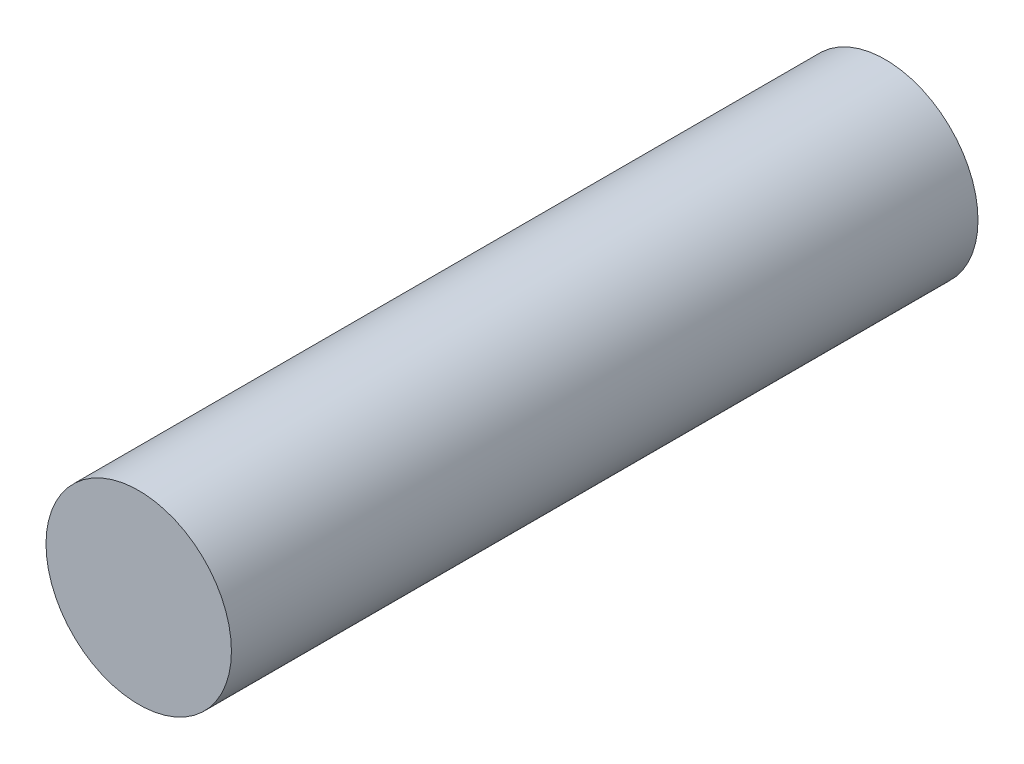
ISO-10303-21;
HEADER;
FILE_DESCRIPTION(('STEP AP214'),'2;1');
FILE_NAME('part.step','',(''),(''),'','','');
FILE_SCHEMA(('AUTOMOTIVE_DESIGN { 1 0 10303 214 1 1 1 1 }'));
ENDSEC;
DATA;
#1=APPLICATION_CONTEXT('core data for automotive mechanical design processes');
#2=APPLICATION_PROTOCOL_DEFINITION('international standard','automotive_design',2000,#1);
#3=PRODUCT_CONTEXT('',#1,'mechanical');
#4=PRODUCT('Part','Part','',(#3));
#5=PRODUCT_RELATED_PRODUCT_CATEGORY('part','',(#4));
#6=PRODUCT_DEFINITION_FORMATION('','',#4);
#7=PRODUCT_DEFINITION_CONTEXT('part definition',#1,'design');
#8=PRODUCT_DEFINITION('design','',#6,#7);
#9=PRODUCT_DEFINITION_SHAPE('','',#8);
#10=(LENGTH_UNIT() NAMED_UNIT(*) SI_UNIT(.MILLI.,.METRE.));
#11=(NAMED_UNIT(*) PLANE_ANGLE_UNIT() SI_UNIT($,.RADIAN.));
#12=(NAMED_UNIT(*) SI_UNIT($,.STERADIAN.) SOLID_ANGLE_UNIT());
#13=UNCERTAINTY_MEASURE_WITH_UNIT(LENGTH_MEASURE(1.E-05),#10,'distance_accuracy_value','');
#14=(GEOMETRIC_REPRESENTATION_CONTEXT(3) GLOBAL_UNCERTAINTY_ASSIGNED_CONTEXT((#13)) GLOBAL_UNIT_ASSIGNED_CONTEXT((#10,
#11,#12)) REPRESENTATION_CONTEXT('',''));
#15=CARTESIAN_POINT('',(0.,0.,0.));
#16=DIRECTION('',(0.,0.,1.));
#17=DIRECTION('',(1.,0.,0.));
#18=AXIS2_PLACEMENT_3D('',#15,#16,#17);
#19=CARTESIAN_POINT('',(0.,0.,153.));
#20=DIRECTION('',(0.,0.,-1.));
#21=DIRECTION('',(-1.,0.,0.));
#22=AXIS2_PLACEMENT_3D('',#19,#20,#21);
#23=CYLINDRICAL_SURFACE('',#22,38.);
#24=CARTESIAN_POINT('',(0.,0.,153.));
#25=DIRECTION('',(0.,0.,1.));
#26=DIRECTION('',(1.,0.,0.));
#27=AXIS2_PLACEMENT_3D('',#24,#25,#26);
#28=CIRCLE('',#27,38.);
#29=CARTESIAN_POINT('',(38.,0.,153.));
#30=VERTEX_POINT('',#29);
#31=EDGE_CURVE('E10',#30,#30,#28,.T.);
#32=ORIENTED_EDGE('',*,*,#31,.F.);
#33=EDGE_LOOP('',(#32));
#34=FACE_BOUND('',#33,.T.);
#35=CARTESIAN_POINT('',(0.,0.,-153.));
#36=DIRECTION('',(0.,0.,1.));
#37=DIRECTION('',(1.,0.,0.));
#38=AXIS2_PLACEMENT_3D('',#35,#36,#37);
#39=CIRCLE('',#38,38.);
#40=CARTESIAN_POINT('',(38.,0.,-153.));
#41=VERTEX_POINT('',#40);
#42=EDGE_CURVE('E34',#41,#41,#39,.T.);
#43=ORIENTED_EDGE('',*,*,#42,.T.);
#44=EDGE_LOOP('',(#43));
#45=FACE_BOUND('',#44,.T.);
#46=ADVANCED_FACE('F31',(#34,#45),#23,.T.);
#47=CARTESIAN_POINT('',(0.,0.,153.));
#48=DIRECTION('',(0.,0.,1.));
#49=DIRECTION('',(1.,0.,0.));
#50=AXIS2_PLACEMENT_3D('',#47,#48,#49);
#51=PLANE('',#50);
#52=ORIENTED_EDGE('',*,*,#31,.T.);
#53=EDGE_LOOP('',(#52));
#54=FACE_BOUND('',#53,.T.);
#55=ADVANCED_FACE('F46',(#54),#51,.T.);
#56=CARTESIAN_POINT('',(0.,0.,-153.));
#57=DIRECTION('',(0.,0.,1.));
#58=DIRECTION('',(1.,0.,0.));
#59=AXIS2_PLACEMENT_3D('',#56,#57,#58);
#60=PLANE('',#59);
#61=ORIENTED_EDGE('',*,*,#42,.F.);
#62=EDGE_LOOP('',(#61));
#63=FACE_BOUND('',#62,.T.);
#64=ADVANCED_FACE('F44',(#63),#60,.F.);
#65=CLOSED_SHELL('',(#46,#55,#64));
#66=MANIFOLD_SOLID_BREP('B2',#65);
#67=ADVANCED_BREP_SHAPE_REPRESENTATION('',(#18,#66),#14);
#68=SHAPE_DEFINITION_REPRESENTATION(#9,#67);
ENDSEC;
END-ISO-10303-21;
